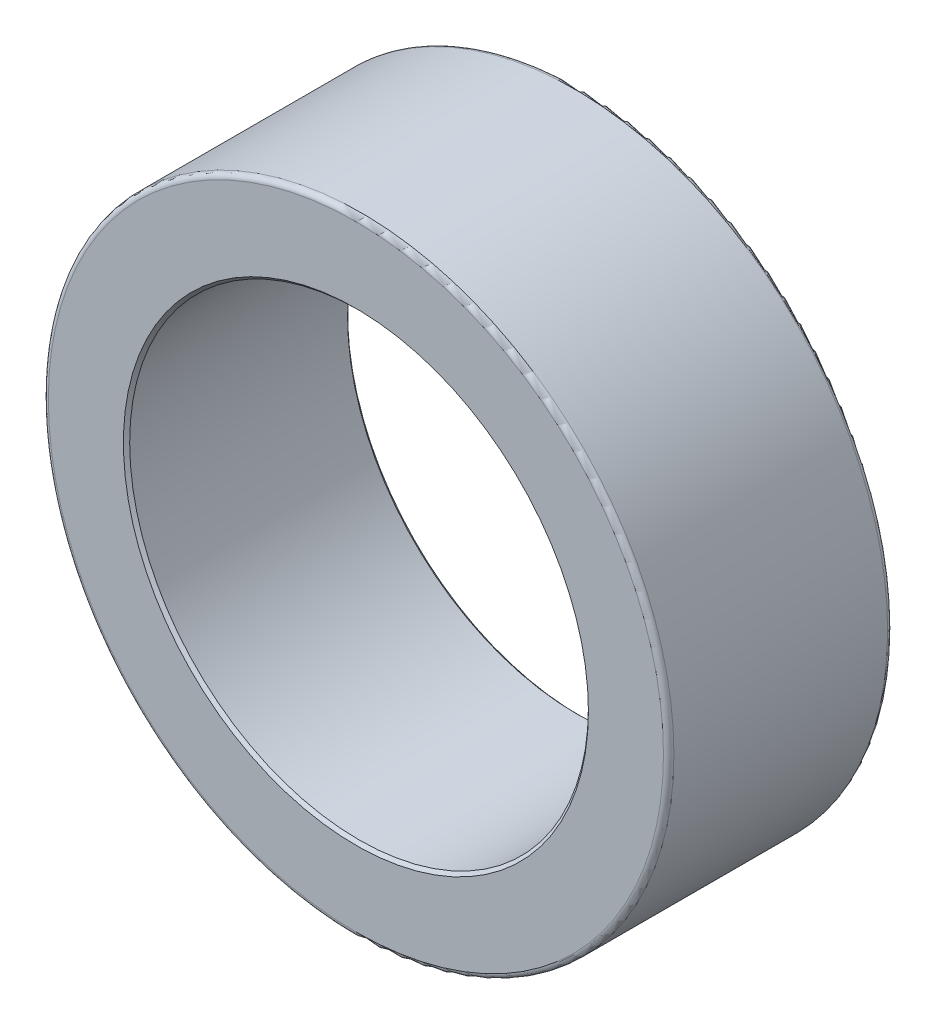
ISO-10303-21;
HEADER;
FILE_DESCRIPTION(('STEP AP214'),'2;1');
FILE_NAME('part.step','',(''),(''),'','','');
FILE_SCHEMA(('AUTOMOTIVE_DESIGN { 1 0 10303 214 1 1 1 1 }'));
ENDSEC;
DATA;
#1=APPLICATION_CONTEXT('core data for automotive mechanical design processes');
#2=APPLICATION_PROTOCOL_DEFINITION('international standard','automotive_design',2000,#1);
#3=PRODUCT_CONTEXT('',#1,'mechanical');
#4=PRODUCT('Part','Part','',(#3));
#5=PRODUCT_RELATED_PRODUCT_CATEGORY('part','',(#4));
#6=PRODUCT_DEFINITION_FORMATION('','',#4);
#7=PRODUCT_DEFINITION_CONTEXT('part definition',#1,'design');
#8=PRODUCT_DEFINITION('design','',#6,#7);
#9=PRODUCT_DEFINITION_SHAPE('','',#8);
#10=(LENGTH_UNIT() NAMED_UNIT(*) SI_UNIT(.MILLI.,.METRE.));
#11=(NAMED_UNIT(*) PLANE_ANGLE_UNIT() SI_UNIT($,.RADIAN.));
#12=(NAMED_UNIT(*) SI_UNIT($,.STERADIAN.) SOLID_ANGLE_UNIT());
#13=UNCERTAINTY_MEASURE_WITH_UNIT(LENGTH_MEASURE(1.E-05),#10,'distance_accuracy_value','');
#14=(GEOMETRIC_REPRESENTATION_CONTEXT(3) GLOBAL_UNCERTAINTY_ASSIGNED_CONTEXT((#13)) GLOBAL_UNIT_ASSIGNED_CONTEXT((#10,
#11,#12)) REPRESENTATION_CONTEXT('',''));
#15=CARTESIAN_POINT('',(0.,0.,0.));
#16=DIRECTION('',(0.,0.,1.));
#17=DIRECTION('',(1.,0.,0.));
#18=AXIS2_PLACEMENT_3D('',#15,#16,#17);
#19=CARTESIAN_POINT('',(0.,0.,-21.5));
#20=DIRECTION('',(0.,0.,1.));
#21=DIRECTION('',(1.,0.,0.));
#22=AXIS2_PLACEMENT_3D('',#19,#20,#21);
#23=CYLINDRICAL_SURFACE('',#22,30.);
#24=CARTESIAN_POINT('',(0.,0.,-21.));
#25=DIRECTION('',(0.,0.,1.));
#26=DIRECTION('',(1.,0.,0.));
#27=AXIS2_PLACEMENT_3D('',#24,#25,#26);
#28=CIRCLE('',#27,30.);
#29=CARTESIAN_POINT('',(30.,0.,-21.));
#30=VERTEX_POINT('',#29);
#31=EDGE_CURVE('E371',#30,#30,#28,.T.);
#32=ORIENTED_EDGE('',*,*,#31,.T.);
#33=EDGE_LOOP('',(#32));
#34=FACE_BOUND('',#33,.T.);
#35=CARTESIAN_POINT('',(0.,0.,-0.5));
#36=DIRECTION('',(0.,0.,1.));
#37=DIRECTION('',(1.,0.,0.));
#38=AXIS2_PLACEMENT_3D('',#35,#36,#37);
#39=CIRCLE('',#38,30.);
#40=CARTESIAN_POINT('',(30.,0.,-0.5));
#41=VERTEX_POINT('',#40);
#42=EDGE_CURVE('E374',#41,#41,#39,.F.);
#43=ORIENTED_EDGE('',*,*,#42,.T.);
#44=EDGE_LOOP('',(#43));
#45=FACE_BOUND('',#44,.T.);
#46=ADVANCED_FACE('F346',(#34,#45),#23,.T.);
#47=CARTESIAN_POINT('',(0.,0.,-21.5));
#48=DIRECTION('',(0.,0.,1.));
#49=DIRECTION('',(1.,0.,0.));
#50=AXIS2_PLACEMENT_3D('',#47,#48,#49);
#51=PLANE('',#50);
#52=CARTESIAN_POINT('',(0.,0.,-21.5));
#53=DIRECTION('',(0.,0.,1.));
#54=DIRECTION('',(1.,0.,0.));
#55=AXIS2_PLACEMENT_3D('',#52,#53,#54);
#56=CIRCLE('',#55,22.3);
#57=CARTESIAN_POINT('',(22.3,0.,-21.5));
#58=VERTEX_POINT('',#57);
#59=EDGE_CURVE('E360',#58,#58,#56,.T.);
#60=ORIENTED_EDGE('',*,*,#59,.T.);
#61=EDGE_LOOP('',(#60));
#62=FACE_BOUND('',#61,.T.);
#63=CARTESIAN_POINT('',(0.,0.,-21.5));
#64=DIRECTION('',(0.,0.,1.));
#65=DIRECTION('',(1.,0.,0.));
#66=AXIS2_PLACEMENT_3D('',#63,#64,#65);
#67=CIRCLE('',#66,29.5);
#68=CARTESIAN_POINT('',(29.5,0.,-21.5));
#69=VERTEX_POINT('',#68);
#70=EDGE_CURVE('E368',#69,#69,#67,.F.);
#71=ORIENTED_EDGE('',*,*,#70,.T.);
#72=EDGE_LOOP('',(#71));
#73=FACE_BOUND('',#72,.T.);
#74=ADVANCED_FACE('F390',(#62,#73),#51,.F.);
#75=CARTESIAN_POINT('',(0.,0.,0.));
#76=DIRECTION('',(0.,0.,1.));
#77=DIRECTION('',(1.,0.,0.));
#78=AXIS2_PLACEMENT_3D('',#75,#76,#77);
#79=PLANE('',#78);
#80=CARTESIAN_POINT('',(0.,0.,0.));
#81=DIRECTION('',(0.,0.,1.));
#82=DIRECTION('',(1.,0.,0.));
#83=AXIS2_PLACEMENT_3D('',#80,#81,#82);
#84=CIRCLE('',#83,22.3);
#85=CARTESIAN_POINT('',(22.3,0.,0.));
#86=VERTEX_POINT('',#85);
#87=EDGE_CURVE('E10',#86,#86,#84,.F.);
#88=ORIENTED_EDGE('',*,*,#87,.T.);
#89=EDGE_LOOP('',(#88));
#90=FACE_BOUND('',#89,.T.);
#91=CARTESIAN_POINT('',(0.,0.,0.));
#92=DIRECTION('',(0.,0.,1.));
#93=DIRECTION('',(1.,0.,0.));
#94=AXIS2_PLACEMENT_3D('',#91,#92,#93);
#95=CIRCLE('',#94,29.5);
#96=CARTESIAN_POINT('',(29.5,0.,0.));
#97=VERTEX_POINT('',#96);
#98=EDGE_CURVE('E365',#97,#97,#95,.T.);
#99=ORIENTED_EDGE('',*,*,#98,.T.);
#100=EDGE_LOOP('',(#99));
#101=FACE_BOUND('',#100,.T.);
#102=ADVANCED_FACE('F387',(#90,#101),#79,.T.);
#103=CARTESIAN_POINT('',(0.,0.,-21.5));
#104=DIRECTION('',(0.,0.,1.));
#105=DIRECTION('',(1.,0.,0.));
#106=AXIS2_PLACEMENT_3D('',#103,#104,#105);
#107=CYLINDRICAL_SURFACE('',#106,22.);
#108=CARTESIAN_POINT('',(0.,0.,-21.2));
#109=DIRECTION('',(0.,0.,1.));
#110=DIRECTION('',(1.,0.,0.));
#111=AXIS2_PLACEMENT_3D('',#108,#109,#110);
#112=CIRCLE('',#111,22.);
#113=CARTESIAN_POINT('',(22.,0.,-21.2));
#114=VERTEX_POINT('',#113);
#115=EDGE_CURVE('E352',#114,#114,#112,.F.);
#116=ORIENTED_EDGE('',*,*,#115,.T.);
#117=EDGE_LOOP('',(#116));
#118=FACE_BOUND('',#117,.T.);
#119=CARTESIAN_POINT('',(0.,0.,-0.300000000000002));
#120=DIRECTION('',(0.,0.,1.));
#121=DIRECTION('',(1.,0.,0.));
#122=AXIS2_PLACEMENT_3D('',#119,#120,#121);
#123=CIRCLE('',#122,22.);
#124=CARTESIAN_POINT('',(22.,0.,-0.300000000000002));
#125=VERTEX_POINT('',#124);
#126=EDGE_CURVE('E356',#125,#125,#123,.T.);
#127=ORIENTED_EDGE('',*,*,#126,.T.);
#128=EDGE_LOOP('',(#127));
#129=FACE_BOUND('',#128,.T.);
#130=ADVANCED_FACE('F389',(#118,#129),#107,.F.);
#131=CARTESIAN_POINT('',(0.,0.,-21.));
#132=DIRECTION('',(0.,0.,1.));
#133=DIRECTION('',(1.,0.,0.));
#134=AXIS2_PLACEMENT_3D('',#131,#132,#133);
#135=TOROIDAL_SURFACE('',#134,29.5,0.5);
#136=ORIENTED_EDGE('',*,*,#70,.F.);
#137=EDGE_LOOP('',(#136));
#138=FACE_BOUND('',#137,.T.);
#139=ORIENTED_EDGE('',*,*,#31,.F.);
#140=EDGE_LOOP('',(#139));
#141=FACE_BOUND('',#140,.T.);
#142=ADVANCED_FACE('F383',(#138,#141),#135,.T.);
#143=CARTESIAN_POINT('',(0.,0.,-0.5));
#144=DIRECTION('',(0.,0.,1.));
#145=DIRECTION('',(1.,0.,0.));
#146=AXIS2_PLACEMENT_3D('',#143,#144,#145);
#147=TOROIDAL_SURFACE('',#146,29.5,0.5);
#148=ORIENTED_EDGE('',*,*,#42,.F.);
#149=EDGE_LOOP('',(#148));
#150=FACE_BOUND('',#149,.T.);
#151=ORIENTED_EDGE('',*,*,#98,.F.);
#152=EDGE_LOOP('',(#151));
#153=FACE_BOUND('',#152,.T.);
#154=ADVANCED_FACE('F379',(#150,#153),#147,.T.);
#155=CARTESIAN_POINT('',(0.,0.,-21.5));
#156=DIRECTION('',(0.,0.,-1.));
#157=DIRECTION('',(-1.,0.,0.));
#158=AXIS2_PLACEMENT_3D('',#155,#156,#157);
#159=CONICAL_SURFACE('',#158,22.3,0.785398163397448);
#160=ORIENTED_EDGE('',*,*,#115,.F.);
#161=EDGE_LOOP('',(#160));
#162=FACE_BOUND('',#161,.T.);
#163=ORIENTED_EDGE('',*,*,#59,.F.);
#164=EDGE_LOOP('',(#163));
#165=FACE_BOUND('',#164,.T.);
#166=ADVANCED_FACE('F382',(#162,#165),#159,.F.);
#167=CARTESIAN_POINT('',(0.,0.,-0.300000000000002));
#168=DIRECTION('',(0.,0.,1.));
#169=DIRECTION('',(1.,0.,0.));
#170=AXIS2_PLACEMENT_3D('',#167,#168,#169);
#171=CONICAL_SURFACE('',#170,22.,0.785398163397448);
#172=ORIENTED_EDGE('',*,*,#87,.F.);
#173=EDGE_LOOP('',(#172));
#174=FACE_BOUND('',#173,.T.);
#175=ORIENTED_EDGE('',*,*,#126,.F.);
#176=EDGE_LOOP('',(#175));
#177=FACE_BOUND('',#176,.T.);
#178=ADVANCED_FACE('F413',(#174,#177),#171,.F.);
#179=CLOSED_SHELL('',(#46,#74,#102,#130,#142,#154,#166,#178));
#180=MANIFOLD_SOLID_BREP('B2',#179);
#181=ADVANCED_BREP_SHAPE_REPRESENTATION('',(#18,#180),#14);
#182=SHAPE_DEFINITION_REPRESENTATION(#9,#181);
ENDSEC;
END-ISO-10303-21;
